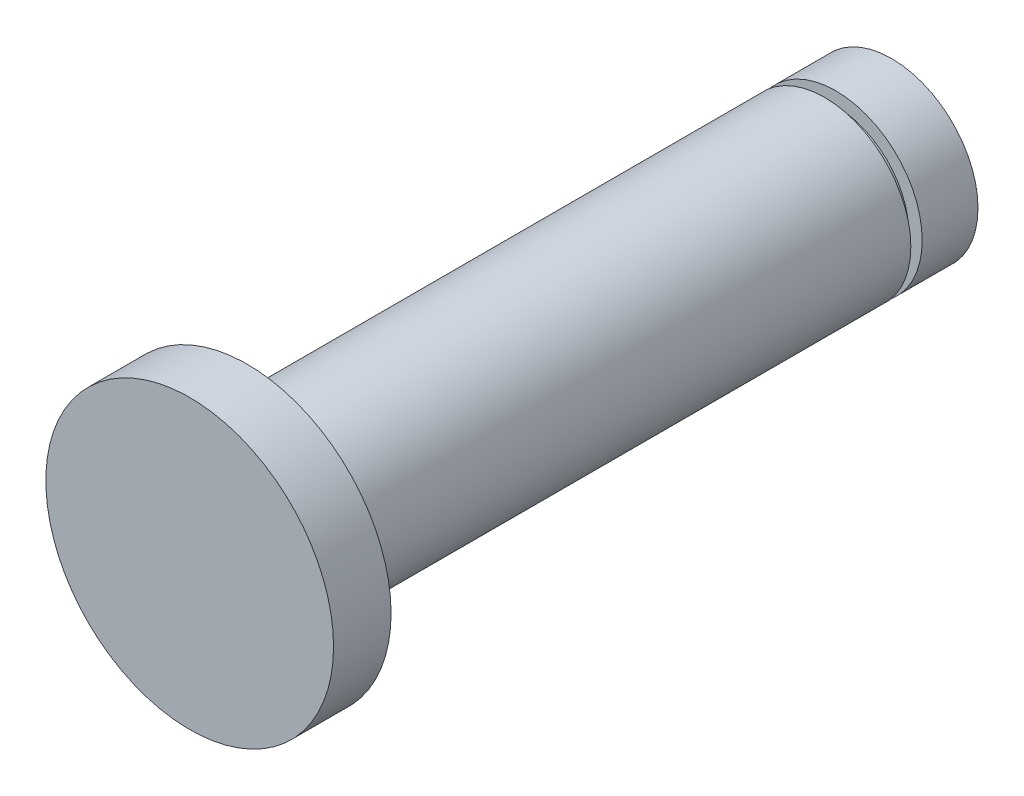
from build123d import *

# Parameters (mm, degrees)
ESQUISSE1_R        = 15
BOSS_EXTRU_1_DEPTH = 112
ESQUISSE2_R        = 25
BOSS_EXTRU_2_DEPTH = 10
ESQUISSE3_W        = 1.969001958
ESQUISSE3_H        = 2.331334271


with BuildPart() as part:
    # Esquisse1 → Boss.-Extru.1 (new body)
    with BuildSketch(Plane.XY):
        Circle(ESQUISSE1_R)
    extrude(amount=BOSS_EXTRU_1_DEPTH)

    # Esquisse2 → Boss.-Extru.2 (add)
    with BuildSketch(Plane.XY.offset(112)):
        Circle(ESQUISSE2_R)
    extrude(amount=BOSS_EXTRU_2_DEPTH)

    # Esquisse3 → Enl_vement de mati_re-R_volution1 (revolve, cut)
    with BuildSketch(Plane(origin=(0, 0, 0), x_dir=(0, 0, -1), z_dir=(1, 0, 0)), mode=Mode.PRIVATE) as enl_vement_de_mati_re_r_volution1_sk:
        with Locations((-10.685163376, 13.834332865)):
            Rectangle(ESQUISSE3_W, ESQUISSE3_H)
    revolve(enl_vement_de_mati_re_r_volution1_sk.sketch.rotate(Axis((0, 0, 0), (0, 0, 1)), 90), axis=Axis((0, 0, 0), (0, 0, 1)), mode=Mode.SUBTRACT)


solid = part.part
